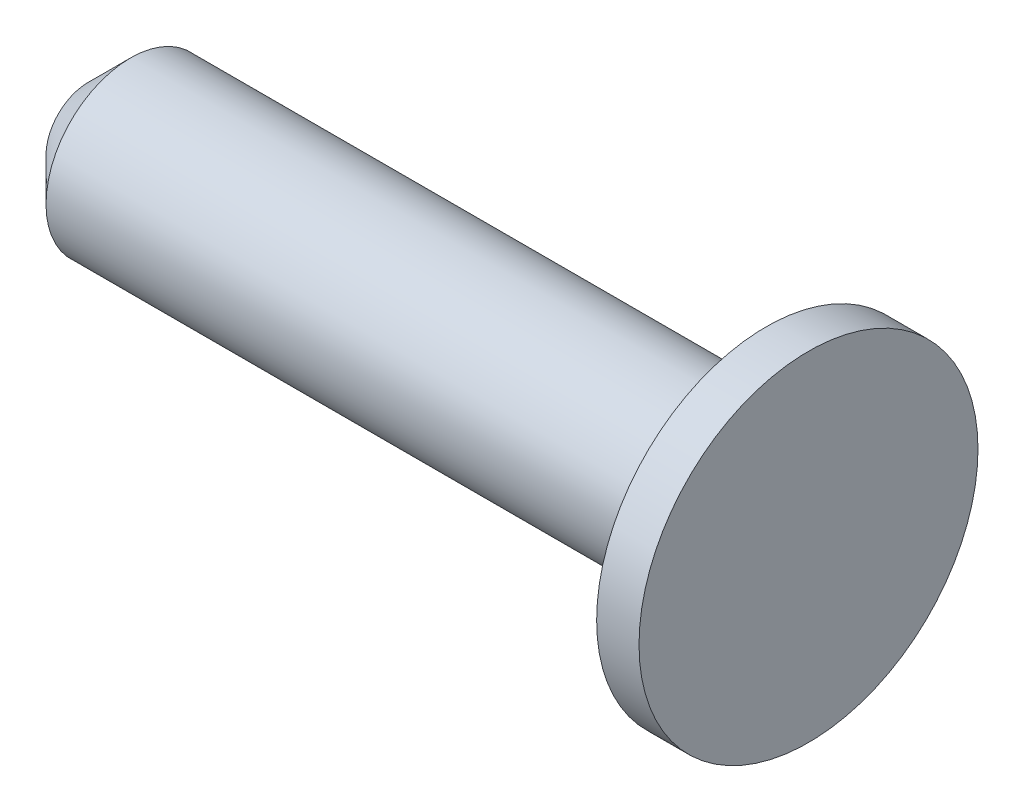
ISO-10303-21;
HEADER;
FILE_DESCRIPTION(('STEP AP214'),'2;1');
FILE_NAME('part.step','',(''),(''),'','','');
FILE_SCHEMA(('AUTOMOTIVE_DESIGN { 1 0 10303 214 1 1 1 1 }'));
ENDSEC;
DATA;
#1=APPLICATION_CONTEXT('core data for automotive mechanical design processes');
#2=APPLICATION_PROTOCOL_DEFINITION('international standard','automotive_design',2000,#1);
#3=PRODUCT_CONTEXT('',#1,'mechanical');
#4=PRODUCT('Part','Part','',(#3));
#5=PRODUCT_RELATED_PRODUCT_CATEGORY('part','',(#4));
#6=PRODUCT_DEFINITION_FORMATION('','',#4);
#7=PRODUCT_DEFINITION_CONTEXT('part definition',#1,'design');
#8=PRODUCT_DEFINITION('design','',#6,#7);
#9=PRODUCT_DEFINITION_SHAPE('','',#8);
#10=(LENGTH_UNIT() NAMED_UNIT(*) SI_UNIT(.MILLI.,.METRE.));
#11=(NAMED_UNIT(*) PLANE_ANGLE_UNIT() SI_UNIT($,.RADIAN.));
#12=(NAMED_UNIT(*) SI_UNIT($,.STERADIAN.) SOLID_ANGLE_UNIT());
#13=UNCERTAINTY_MEASURE_WITH_UNIT(LENGTH_MEASURE(1.E-05),#10,'distance_accuracy_value','');
#14=(GEOMETRIC_REPRESENTATION_CONTEXT(3) GLOBAL_UNCERTAINTY_ASSIGNED_CONTEXT((#13)) GLOBAL_UNIT_ASSIGNED_CONTEXT((#10,
#11,#12)) REPRESENTATION_CONTEXT('',''));
#15=CARTESIAN_POINT('',(0.,0.,0.));
#16=DIRECTION('',(0.,0.,1.));
#17=DIRECTION('',(1.,0.,0.));
#18=AXIS2_PLACEMENT_3D('',#15,#16,#17);
#19=CARTESIAN_POINT('',(0.,0.,0.));
#20=DIRECTION('',(1.,0.,0.));
#21=DIRECTION('',(0.,0.,-1.));
#22=AXIS2_PLACEMENT_3D('',#19,#20,#21);
#23=PLANE('',#22);
#24=CARTESIAN_POINT('',(0.,0.,0.));
#25=DIRECTION('',(1.,0.,0.));
#26=DIRECTION('',(0.,0.,-1.));
#27=AXIS2_PLACEMENT_3D('',#24,#25,#26);
#28=CIRCLE('',#27,0.994999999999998);
#29=CARTESIAN_POINT('',(0.,0.,-0.994999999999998));
#30=VERTEX_POINT('',#29);
#31=EDGE_CURVE('E35',#30,#30,#28,.F.);
#32=ORIENTED_EDGE('',*,*,#31,.T.);
#33=EDGE_LOOP('',(#32));
#34=FACE_BOUND('',#33,.T.);
#35=ADVANCED_FACE('F28',(#34),#23,.F.);
#36=CARTESIAN_POINT('',(0.,0.,0.));
#37=DIRECTION('',(-1.,0.,0.));
#38=DIRECTION('',(0.,0.,1.));
#39=AXIS2_PLACEMENT_3D('',#36,#37,#38);
#40=CYLINDRICAL_SURFACE('',#39,1.995);
#41=CARTESIAN_POINT('',(1.00000000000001,0.,0.));
#42=DIRECTION('',(1.,0.,0.));
#43=DIRECTION('',(0.,0.,-1.));
#44=AXIS2_PLACEMENT_3D('',#41,#42,#43);
#45=CIRCLE('',#44,1.995);
#46=CARTESIAN_POINT('',(1.00000000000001,0.,-1.995));
#47=VERTEX_POINT('',#46);
#48=EDGE_CURVE('E10',#47,#47,#45,.T.);
#49=ORIENTED_EDGE('',*,*,#48,.T.);
#50=EDGE_LOOP('',(#49));
#51=FACE_BOUND('',#50,.T.);
#52=CARTESIAN_POINT('',(16.,0.,0.));
#53=DIRECTION('',(-1.,0.,0.));
#54=DIRECTION('',(0.,0.,1.));
#55=AXIS2_PLACEMENT_3D('',#52,#53,#54);
#56=CIRCLE('',#55,1.995);
#57=CARTESIAN_POINT('',(16.,0.,1.995));
#58=VERTEX_POINT('',#57);
#59=EDGE_CURVE('E39',#58,#58,#56,.T.);
#60=ORIENTED_EDGE('',*,*,#59,.T.);
#61=EDGE_LOOP('',(#60));
#62=FACE_BOUND('',#61,.T.);
#63=ADVANCED_FACE('F66',(#51,#62),#40,.T.);
#64=CARTESIAN_POINT('',(16.,1.995,0.));
#65=DIRECTION('',(1.,0.,0.));
#66=DIRECTION('',(0.,0.,-1.));
#67=AXIS2_PLACEMENT_3D('',#64,#65,#66);
#68=PLANE('',#67);
#69=ORIENTED_EDGE('',*,*,#59,.F.);
#70=EDGE_LOOP('',(#69));
#71=FACE_BOUND('',#70,.T.);
#72=CARTESIAN_POINT('',(16.,0.,0.));
#73=DIRECTION('',(-1.,0.,0.));
#74=DIRECTION('',(0.,0.,1.));
#75=AXIS2_PLACEMENT_3D('',#72,#73,#74);
#76=CIRCLE('',#75,4.);
#77=CARTESIAN_POINT('',(16.,0.,4.));
#78=VERTEX_POINT('',#77);
#79=EDGE_CURVE('E43',#78,#78,#76,.T.);
#80=ORIENTED_EDGE('',*,*,#79,.T.);
#81=EDGE_LOOP('',(#80));
#82=FACE_BOUND('',#81,.T.);
#83=ADVANCED_FACE('F62',(#71,#82),#68,.F.);
#84=CARTESIAN_POINT('',(0.,0.,0.));
#85=DIRECTION('',(-1.,0.,0.));
#86=DIRECTION('',(0.,0.,1.));
#87=AXIS2_PLACEMENT_3D('',#84,#85,#86);
#88=CYLINDRICAL_SURFACE('',#87,4.);
#89=ORIENTED_EDGE('',*,*,#79,.F.);
#90=EDGE_LOOP('',(#89));
#91=FACE_BOUND('',#90,.T.);
#92=CARTESIAN_POINT('',(17.,0.,0.));
#93=DIRECTION('',(-1.,0.,0.));
#94=DIRECTION('',(0.,0.,1.));
#95=AXIS2_PLACEMENT_3D('',#92,#93,#94);
#96=CIRCLE('',#95,4.);
#97=CARTESIAN_POINT('',(17.,0.,4.));
#98=VERTEX_POINT('',#97);
#99=EDGE_CURVE('E48',#98,#98,#96,.T.);
#100=ORIENTED_EDGE('',*,*,#99,.T.);
#101=EDGE_LOOP('',(#100));
#102=FACE_BOUND('',#101,.T.);
#103=ADVANCED_FACE('F52',(#91,#102),#88,.T.);
#104=CARTESIAN_POINT('',(17.,4.,0.));
#105=DIRECTION('',(-1.,0.,0.));
#106=DIRECTION('',(0.,0.,1.));
#107=AXIS2_PLACEMENT_3D('',#104,#105,#106);
#108=PLANE('',#107);
#109=ORIENTED_EDGE('',*,*,#99,.F.);
#110=EDGE_LOOP('',(#109));
#111=FACE_BOUND('',#110,.T.);
#112=ADVANCED_FACE('F54',(#111),#108,.F.);
#113=CARTESIAN_POINT('',(0.,0.,0.));
#114=DIRECTION('',(1.,0.,0.));
#115=DIRECTION('',(0.,0.,-1.));
#116=AXIS2_PLACEMENT_3D('',#113,#114,#115);
#117=CONICAL_SURFACE('',#116,0.994999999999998,0.785398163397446);
#118=ORIENTED_EDGE('',*,*,#48,.F.);
#119=EDGE_LOOP('',(#118));
#120=FACE_BOUND('',#119,.T.);
#121=ORIENTED_EDGE('',*,*,#31,.F.);
#122=EDGE_LOOP('',(#121));
#123=FACE_BOUND('',#122,.T.);
#124=ADVANCED_FACE('F30',(#120,#123),#117,.T.);
#125=CLOSED_SHELL('',(#35,#63,#83,#103,#112,#124));
#126=MANIFOLD_SOLID_BREP('B2',#125);
#127=ADVANCED_BREP_SHAPE_REPRESENTATION('',(#18,#126),#14);
#128=SHAPE_DEFINITION_REPRESENTATION(#9,#127);
ENDSEC;
END-ISO-10303-21;
